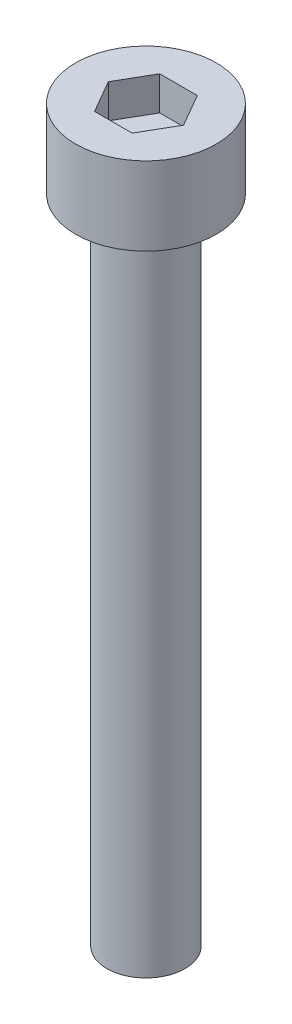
from build123d import *

# Parameters (mm, degrees)
SKETCH_1_R          = 1.5
EXTRUDE_1_DEPTH     = 25
SKETCH_2_R          = 2.7
EXTRUDE_2_DEPTH     = 3
CUT_EXTRUDE_1_DEPTH = 1.3


with BuildPart() as part:
    # Sketch 1 → Extrude 1 (new body)
    with BuildSketch(Plane(origin=(0, 0, 0), x_dir=(1, 0, 0), z_dir=(0, 1, 0))):
        with Locations(Location((0, 0, 0), (0, 0, 270))):
            Circle(SKETCH_1_R)
    extrude(amount=EXTRUDE_1_DEPTH)

    # Sketch 2 → Extrude 2 (add)
    with BuildSketch(Plane(origin=(0, 25, 0), x_dir=(1, 0, 0), z_dir=(0, 1, 0))):
        with Locations(Location((0, 0, 0), (0, 0, 270))):
            Circle(SKETCH_2_R)
    extrude(amount=EXTRUDE_2_DEPTH)

    # Sketch 3 → Cut-Extrude 1 (cut)
    with BuildSketch(Plane(origin=(0, 28, 0), x_dir=(1, 0, 0), z_dir=(0, 1, 0))):
        Polygon((1.443375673, 0), (0.721687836, 1.25), (-0.721687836, 1.25), (-1.443375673, 0), (-0.721687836, -1.25), (0.721687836, -1.25), align=None)
    extrude(amount=-CUT_EXTRUDE_1_DEPTH, mode=Mode.SUBTRACT)


solid = part.part
